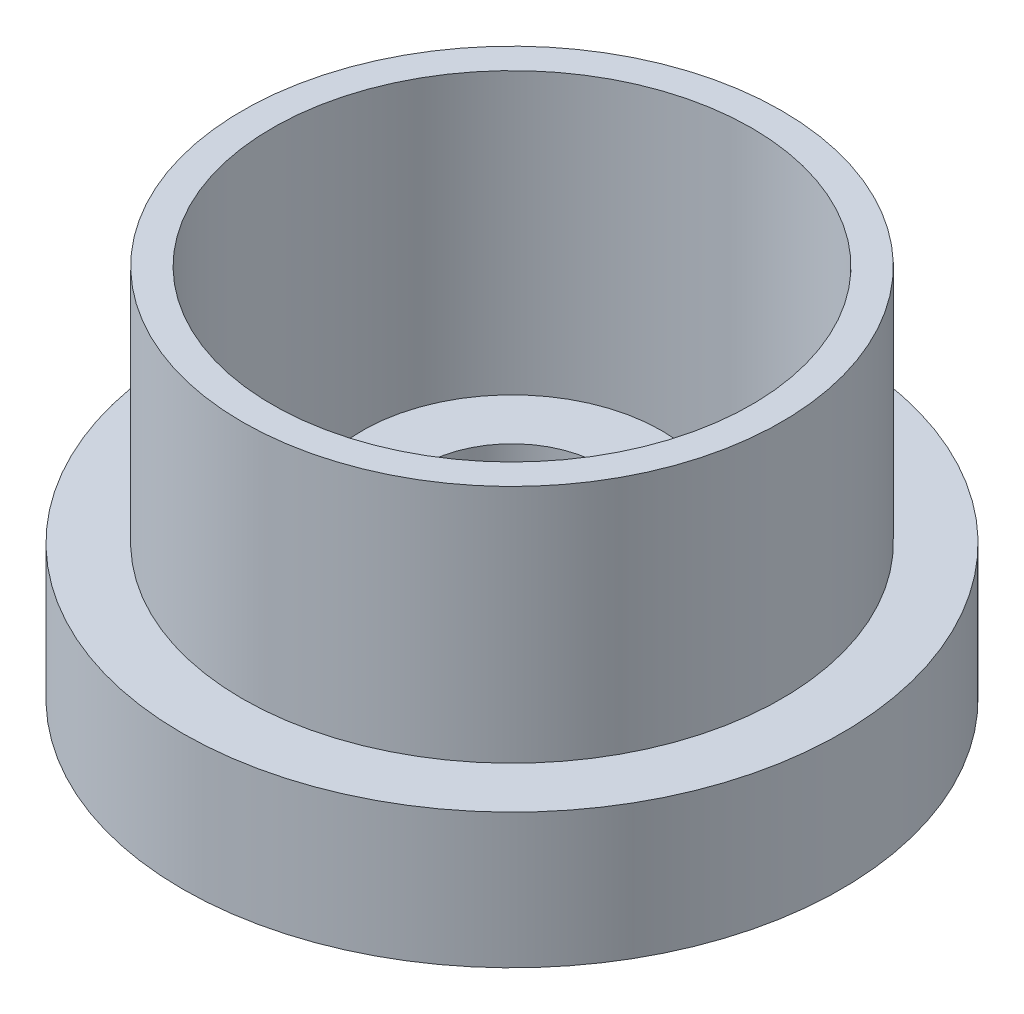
from build123d import *


with BuildPart() as part:
    # Esquisse1 → Base-R_volution (revolve)
    with BuildSketch(Plane.XY, mode=Mode.PRIVATE) as base_r_volution_sk:
        Polygon((-6, 0), (-6, 10.5), (-10, 10.5), (-10, 5), (-16, 5), (-16, 25), (-18, 25), (-18, 9), (-22, 9), (-22, 0), align=None)
    revolve(base_r_volution_sk.sketch.rotate(Axis((0, -75.104513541, 0), (0, 1, 0)), 270), axis=Axis((0, -75.104513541, 0), (0, 1, 0)))


solid = part.part
